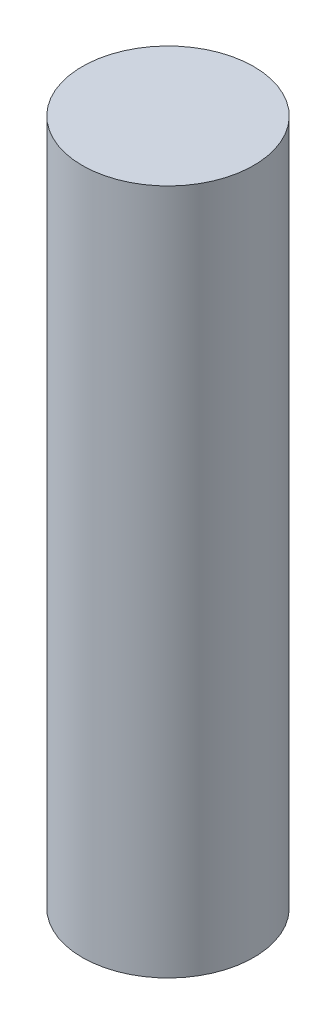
from build123d import *

# Parameters (mm, degrees)
CROQUIS1_R              = 2.5
SALIENTE_EXTRUIR1_DEPTH = 10


with BuildPart() as part:
    # Croquis1 → Saliente-Extruir1 (new, symmetric)
    with BuildSketch(Plane(origin=(0, 0, 0), x_dir=(1, 0, 0), z_dir=(0, 1, 0))):
        with Locations(Location((0, 0, 0), (0, 0, 270))):
            Circle(CROQUIS1_R)
    extrude(amount=SALIENTE_EXTRUIR1_DEPTH, both=True)


solid = part.part
